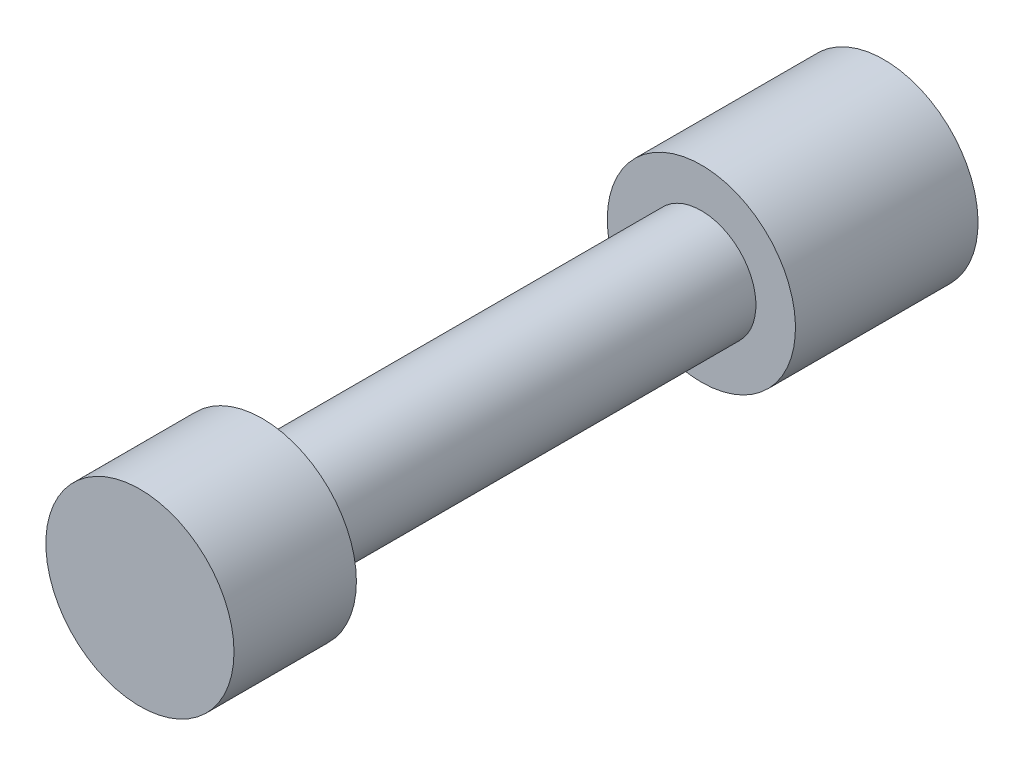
ISO-10303-21;
HEADER;
FILE_DESCRIPTION(('STEP AP214'),'2;1');
FILE_NAME('part.step','',(''),(''),'','','');
FILE_SCHEMA(('AUTOMOTIVE_DESIGN { 1 0 10303 214 1 1 1 1 }'));
ENDSEC;
DATA;
#1=APPLICATION_CONTEXT('core data for automotive mechanical design processes');
#2=APPLICATION_PROTOCOL_DEFINITION('international standard','automotive_design',2000,#1);
#3=PRODUCT_CONTEXT('',#1,'mechanical');
#4=PRODUCT('Part','Part','',(#3));
#5=PRODUCT_RELATED_PRODUCT_CATEGORY('part','',(#4));
#6=PRODUCT_DEFINITION_FORMATION('','',#4);
#7=PRODUCT_DEFINITION_CONTEXT('part definition',#1,'design');
#8=PRODUCT_DEFINITION('design','',#6,#7);
#9=PRODUCT_DEFINITION_SHAPE('','',#8);
#10=(LENGTH_UNIT() NAMED_UNIT(*) SI_UNIT(.MILLI.,.METRE.));
#11=(NAMED_UNIT(*) PLANE_ANGLE_UNIT() SI_UNIT($,.RADIAN.));
#12=(NAMED_UNIT(*) SI_UNIT($,.STERADIAN.) SOLID_ANGLE_UNIT());
#13=UNCERTAINTY_MEASURE_WITH_UNIT(LENGTH_MEASURE(1.E-05),#10,'distance_accuracy_value','');
#14=(GEOMETRIC_REPRESENTATION_CONTEXT(3) GLOBAL_UNCERTAINTY_ASSIGNED_CONTEXT((#13)) GLOBAL_UNIT_ASSIGNED_CONTEXT((#10,
#11,#12)) REPRESENTATION_CONTEXT('',''));
#15=CARTESIAN_POINT('',(0.,0.,0.));
#16=DIRECTION('',(0.,0.,1.));
#17=DIRECTION('',(1.,0.,0.));
#18=AXIS2_PLACEMENT_3D('',#15,#16,#17);
#19=CARTESIAN_POINT('',(0.,0.,-136.926757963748));
#20=DIRECTION('',(0.,0.,1.));
#21=DIRECTION('',(0.,-1.,0.));
#22=AXIS2_PLACEMENT_3D('',#19,#20,#21);
#23=CYLINDRICAL_SURFACE('',#22,8.2804);
#24=CARTESIAN_POINT('',(0.,0.,-18.58645));
#25=DIRECTION('',(0.,0.,-1.));
#26=DIRECTION('',(0.,1.,0.));
#27=AXIS2_PLACEMENT_3D('',#24,#25,#26);
#28=CIRCLE('',#27,8.2804);
#29=CARTESIAN_POINT('',(0.,8.2804,-18.58645));
#30=VERTEX_POINT('',#29);
#31=EDGE_CURVE('E45',#30,#30,#28,.T.);
#32=ORIENTED_EDGE('',*,*,#31,.T.);
#33=EDGE_LOOP('',(#32));
#34=FACE_BOUND('',#33,.T.);
#35=CARTESIAN_POINT('',(0.,0.,-85.26145));
#36=DIRECTION('',(0.,0.,-1.));
#37=DIRECTION('',(-1.,0.,0.));
#38=AXIS2_PLACEMENT_3D('',#35,#36,#37);
#39=CIRCLE('',#38,8.2804);
#40=CARTESIAN_POINT('',(-8.2804,0.,-85.26145));
#41=VERTEX_POINT('',#40);
#42=EDGE_CURVE('E10',#41,#41,#39,.T.);
#43=ORIENTED_EDGE('',*,*,#42,.F.);
#44=EDGE_LOOP('',(#43));
#45=FACE_BOUND('',#44,.T.);
#46=ADVANCED_FACE('F34',(#34,#45),#23,.T.);
#47=CARTESIAN_POINT('',(0.,0.,-18.58645));
#48=DIRECTION('',(0.,0.,-1.));
#49=DIRECTION('',(-1.,0.,0.));
#50=AXIS2_PLACEMENT_3D('',#47,#48,#49);
#51=PLANE('',#50);
#52=ORIENTED_EDGE('',*,*,#31,.F.);
#53=EDGE_LOOP('',(#52));
#54=FACE_BOUND('',#53,.T.);
#55=CARTESIAN_POINT('',(0.,0.,-18.58645));
#56=DIRECTION('',(0.,0.,-1.));
#57=DIRECTION('',(0.,1.,0.));
#58=AXIS2_PLACEMENT_3D('',#55,#56,#57);
#59=CIRCLE('',#58,14.2875);
#60=CARTESIAN_POINT('',(0.,14.2875,-18.58645));
#61=VERTEX_POINT('',#60);
#62=EDGE_CURVE('E49',#61,#61,#59,.F.);
#63=ORIENTED_EDGE('',*,*,#62,.F.);
#64=EDGE_LOOP('',(#63));
#65=FACE_BOUND('',#64,.T.);
#66=ADVANCED_FACE('F36',(#54,#65),#51,.T.);
#67=CARTESIAN_POINT('',(0.,0.,0.));
#68=DIRECTION('',(0.,0.,1.));
#69=DIRECTION('',(1.,0.,0.));
#70=AXIS2_PLACEMENT_3D('',#67,#68,#69);
#71=PLANE('',#70);
#72=CARTESIAN_POINT('',(0.,0.,0.));
#73=DIRECTION('',(0.,0.,1.));
#74=DIRECTION('',(1.,0.,0.));
#75=AXIS2_PLACEMENT_3D('',#72,#73,#74);
#76=CIRCLE('',#75,14.2875);
#77=CARTESIAN_POINT('',(14.2875,0.,0.));
#78=VERTEX_POINT('',#77);
#79=EDGE_CURVE('E54',#78,#78,#76,.T.);
#80=ORIENTED_EDGE('',*,*,#79,.T.);
#81=EDGE_LOOP('',(#80));
#82=FACE_BOUND('',#81,.T.);
#83=ADVANCED_FACE('F80',(#82),#71,.T.);
#84=CARTESIAN_POINT('',(0.,0.,-58.9976025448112));
#85=DIRECTION('',(0.,0.,1.));
#86=DIRECTION('',(1.,0.,0.));
#87=AXIS2_PLACEMENT_3D('',#84,#85,#86);
#88=CYLINDRICAL_SURFACE('',#87,14.2875);
#89=ORIENTED_EDGE('',*,*,#79,.F.);
#90=EDGE_LOOP('',(#89));
#91=FACE_BOUND('',#90,.T.);
#92=ORIENTED_EDGE('',*,*,#62,.T.);
#93=EDGE_LOOP('',(#92));
#94=FACE_BOUND('',#93,.T.);
#95=ADVANCED_FACE('F71',(#91,#94),#88,.T.);
#96=CARTESIAN_POINT('',(0.,0.,-85.26145));
#97=DIRECTION('',(0.,0.,-1.));
#98=DIRECTION('',(-1.,0.,0.));
#99=AXIS2_PLACEMENT_3D('',#96,#97,#98);
#100=PLANE('',#99);
#101=ORIENTED_EDGE('',*,*,#42,.T.);
#102=EDGE_LOOP('',(#101));
#103=FACE_BOUND('',#102,.T.);
#104=CARTESIAN_POINT('',(0.,0.,-85.26145));
#105=DIRECTION('',(0.,0.,-1.));
#106=DIRECTION('',(-1.,0.,0.));
#107=AXIS2_PLACEMENT_3D('',#104,#105,#106);
#108=CIRCLE('',#107,14.2875);
#109=CARTESIAN_POINT('',(-14.2875,0.,-85.26145));
#110=VERTEX_POINT('',#109);
#111=EDGE_CURVE('E63',#110,#110,#108,.T.);
#112=ORIENTED_EDGE('',*,*,#111,.F.);
#113=EDGE_LOOP('',(#112));
#114=FACE_BOUND('',#113,.T.);
#115=ADVANCED_FACE('F69',(#103,#114),#100,.F.);
#116=CARTESIAN_POINT('',(0.,0.,-153.399877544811));
#117=DIRECTION('',(0.,0.,1.));
#118=DIRECTION('',(1.,0.,0.));
#119=AXIS2_PLACEMENT_3D('',#116,#117,#118);
#120=CYLINDRICAL_SURFACE('',#119,14.2875);
#121=CARTESIAN_POINT('',(0.,0.,-112.988725));
#122=DIRECTION('',(0.,0.,1.));
#123=DIRECTION('',(0.,-1.,0.));
#124=AXIS2_PLACEMENT_3D('',#121,#122,#123);
#125=CIRCLE('',#124,14.2875);
#126=CARTESIAN_POINT('',(0.,-14.2875,-112.988725));
#127=VERTEX_POINT('',#126);
#128=EDGE_CURVE('E59',#127,#127,#125,.T.);
#129=ORIENTED_EDGE('',*,*,#128,.T.);
#130=EDGE_LOOP('',(#129));
#131=FACE_BOUND('',#130,.T.);
#132=ORIENTED_EDGE('',*,*,#111,.T.);
#133=EDGE_LOOP('',(#132));
#134=FACE_BOUND('',#133,.T.);
#135=ADVANCED_FACE('F67',(#131,#134),#120,.T.);
#136=CARTESIAN_POINT('',(-8.24889197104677,-14.2875,-112.988725));
#137=DIRECTION('',(0.,0.,1.));
#138=DIRECTION('',(0.,1.,0.));
#139=AXIS2_PLACEMENT_3D('',#136,#137,#138);
#140=PLANE('',#139);
#141=CARTESIAN_POINT('',(0.,0.,-112.988725));
#142=DIRECTION('',(0.,0.,1.));
#143=DIRECTION('',(0.,-1.,0.));
#144=AXIS2_PLACEMENT_3D('',#141,#142,#143);
#145=CIRCLE('',#144,8.2804);
#146=CARTESIAN_POINT('',(0.,-8.2804,-112.988725));
#147=VERTEX_POINT('',#146);
#148=EDGE_CURVE('E41',#147,#147,#145,.T.);
#149=ORIENTED_EDGE('',*,*,#148,.T.);
#150=EDGE_LOOP('',(#149));
#151=FACE_BOUND('',#150,.T.);
#152=ORIENTED_EDGE('',*,*,#128,.F.);
#153=EDGE_LOOP('',(#152));
#154=FACE_BOUND('',#153,.T.);
#155=ADVANCED_FACE('F77',(#151,#154),#140,.F.);
#156=CARTESIAN_POINT('',(0.,0.,-113.50625));
#157=DIRECTION('',(0.,0.,-1.));
#158=DIRECTION('',(-1.,0.,0.));
#159=AXIS2_PLACEMENT_3D('',#156,#157,#158);
#160=PLANE('',#159);
#161=CARTESIAN_POINT('',(0.,0.,-113.50625));
#162=DIRECTION('',(0.,0.,-1.));
#163=DIRECTION('',(0.,1.,0.));
#164=AXIS2_PLACEMENT_3D('',#161,#162,#163);
#165=CIRCLE('',#164,8.2804);
#166=CARTESIAN_POINT('',(0.,8.2804,-113.50625));
#167=VERTEX_POINT('',#166);
#168=EDGE_CURVE('E57',#167,#167,#165,.T.);
#169=ORIENTED_EDGE('',*,*,#168,.T.);
#170=EDGE_LOOP('',(#169));
#171=FACE_BOUND('',#170,.T.);
#172=ADVANCED_FACE('F94',(#171),#160,.T.);
#173=ORIENTED_EDGE('',*,*,#168,.F.);
#174=EDGE_LOOP('',(#173));
#175=FACE_BOUND('',#174,.T.);
#176=ORIENTED_EDGE('',*,*,#148,.F.);
#177=EDGE_LOOP('',(#176));
#178=FACE_BOUND('',#177,.T.);
#179=ADVANCED_FACE('F86',(#175,#178),#23,.T.);
#180=CLOSED_SHELL('',(#46,#66,#83,#95,#115,#135,#155,#172,#179));
#181=MANIFOLD_SOLID_BREP('B2',#180);
#182=ADVANCED_BREP_SHAPE_REPRESENTATION('',(#18,#181),#14);
#183=SHAPE_DEFINITION_REPRESENTATION(#9,#182);
ENDSEC;
END-ISO-10303-21;
